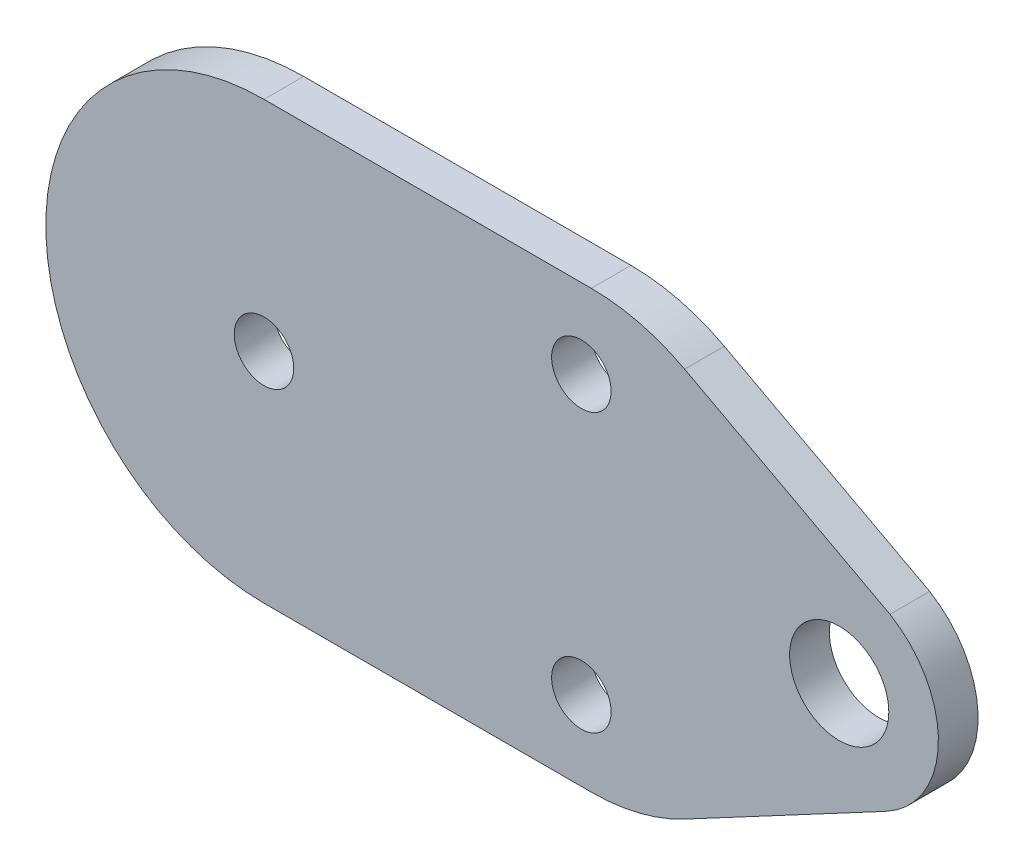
ISO-10303-21;
HEADER;
FILE_DESCRIPTION(('STEP AP214'),'2;1');
FILE_NAME('part.step','',(''),(''),'','','');
FILE_SCHEMA(('AUTOMOTIVE_DESIGN { 1 0 10303 214 1 1 1 1 }'));
ENDSEC;
DATA;
#1=APPLICATION_CONTEXT('core data for automotive mechanical design processes');
#2=APPLICATION_PROTOCOL_DEFINITION('international standard','automotive_design',2000,#1);
#3=PRODUCT_CONTEXT('',#1,'mechanical');
#4=PRODUCT('Part','Part','',(#3));
#5=PRODUCT_RELATED_PRODUCT_CATEGORY('part','',(#4));
#6=PRODUCT_DEFINITION_FORMATION('','',#4);
#7=PRODUCT_DEFINITION_CONTEXT('part definition',#1,'design');
#8=PRODUCT_DEFINITION('design','',#6,#7);
#9=PRODUCT_DEFINITION_SHAPE('','',#8);
#10=(LENGTH_UNIT() NAMED_UNIT(*) SI_UNIT(.MILLI.,.METRE.));
#11=(NAMED_UNIT(*) PLANE_ANGLE_UNIT() SI_UNIT($,.RADIAN.));
#12=(NAMED_UNIT(*) SI_UNIT($,.STERADIAN.) SOLID_ANGLE_UNIT());
#13=UNCERTAINTY_MEASURE_WITH_UNIT(LENGTH_MEASURE(1.E-05),#10,'distance_accuracy_value','');
#14=(GEOMETRIC_REPRESENTATION_CONTEXT(3) GLOBAL_UNCERTAINTY_ASSIGNED_CONTEXT((#13)) GLOBAL_UNIT_ASSIGNED_CONTEXT((#10,
#11,#12)) REPRESENTATION_CONTEXT('',''));
#15=CARTESIAN_POINT('',(0.,0.,0.));
#16=DIRECTION('',(0.,0.,1.));
#17=DIRECTION('',(1.,0.,0.));
#18=AXIS2_PLACEMENT_3D('',#15,#16,#17);
#19=CARTESIAN_POINT('',(0.,0.,2.));
#20=DIRECTION('',(0.,0.,-1.));
#21=DIRECTION('',(-1.,0.,0.));
#22=AXIS2_PLACEMENT_3D('',#19,#20,#21);
#23=PLANE('',#22);
#24=CARTESIAN_POINT('',(16.,-7.,2.));
#25=DIRECTION('',(0.,0.,1.));
#26=DIRECTION('',(-1.,0.,0.));
#27=AXIS2_PLACEMENT_3D('',#24,#25,#26);
#28=CIRCLE('',#27,1.5);
#29=CARTESIAN_POINT('',(14.5,-7.,2.));
#30=VERTEX_POINT('',#29);
#31=EDGE_CURVE('E277',#30,#30,#28,.T.);
#32=ORIENTED_EDGE('',*,*,#31,.F.);
#33=EDGE_LOOP('',(#32));
#34=FACE_BOUND('',#33,.T.);
#35=CARTESIAN_POINT('',(0.,0.,2.));
#36=DIRECTION('',(0.,0.,1.));
#37=DIRECTION('',(1.,0.,0.));
#38=AXIS2_PLACEMENT_3D('',#35,#36,#37);
#39=CIRCLE('',#38,1.5);
#40=CARTESIAN_POINT('',(1.5,0.,2.));
#41=VERTEX_POINT('',#40);
#42=EDGE_CURVE('E118',#41,#41,#39,.T.);
#43=ORIENTED_EDGE('',*,*,#42,.F.);
#44=EDGE_LOOP('',(#43));
#45=FACE_BOUND('',#44,.T.);
#46=DIRECTION('',(1.,0.,0.));
#47=VECTOR('',#46,1.);
#48=CARTESIAN_POINT('',(0.,-11.,2.));
#49=LINE('',#48,#47);
#50=CARTESIAN_POINT('',(0.,-11.,2.));
#51=VERTEX_POINT('',#50);
#52=CARTESIAN_POINT('',(16.5,-11.,2.));
#53=VERTEX_POINT('',#52);
#54=EDGE_CURVE('E108',#51,#53,#49,.T.);
#55=ORIENTED_EDGE('',*,*,#54,.T.);
#56=CARTESIAN_POINT('',(16.5,-0.999999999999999,2.));
#57=DIRECTION('',(0.,0.,-1.));
#58=DIRECTION('',(-1.,0.,0.));
#59=AXIS2_PLACEMENT_3D('',#56,#57,#58);
#60=CIRCLE('',#59,10.);
#61=CARTESIAN_POINT('',(21.2058823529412,-9.82352941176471,2.));
#62=VERTEX_POINT('',#61);
#63=EDGE_CURVE('E157',#53,#62,#60,.F.);
#64=ORIENTED_EDGE('',*,*,#63,.T.);
#65=DIRECTION('',(0.882352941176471,0.470588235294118,0.));
#66=VECTOR('',#65,1.);
#67=CARTESIAN_POINT('',(19.,-11.,2.));
#68=LINE('',#67,#66);
#69=CARTESIAN_POINT('',(31.3529411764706,-4.41176470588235,2.));
#70=VERTEX_POINT('',#69);
#71=EDGE_CURVE('E135',#62,#70,#68,.T.);
#72=ORIENTED_EDGE('',*,*,#71,.T.);
#73=CARTESIAN_POINT('',(29.,0.,2.));
#74=DIRECTION('',(0.,0.,1.));
#75=DIRECTION('',(1.,0.,0.));
#76=AXIS2_PLACEMENT_3D('',#73,#74,#75);
#77=CIRCLE('',#76,5.);
#78=CARTESIAN_POINT('',(31.5585354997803,4.29579982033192,2.));
#79=VERTEX_POINT('',#78);
#80=EDGE_CURVE('E137',#70,#79,#77,.T.);
#81=ORIENTED_EDGE('',*,*,#80,.T.);
#82=DIRECTION('',(-0.882168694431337,0.470933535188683,0.));
#83=VECTOR('',#82,1.);
#84=CARTESIAN_POINT('',(19.,11.,2.));
#85=LINE('',#84,#83);
#86=CARTESIAN_POINT('',(21.2072560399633,9.82168694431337,2.));
#87=VERTEX_POINT('',#86);
#88=EDGE_CURVE('E139',#79,#87,#85,.T.);
#89=ORIENTED_EDGE('',*,*,#88,.T.);
#90=CARTESIAN_POINT('',(16.4979206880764,0.999999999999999,2.));
#91=DIRECTION('',(0.,0.,-1.));
#92=DIRECTION('',(-1.,0.,0.));
#93=AXIS2_PLACEMENT_3D('',#90,#91,#92);
#94=CIRCLE('',#93,10.);
#95=CARTESIAN_POINT('',(16.4979206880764,11.,2.));
#96=VERTEX_POINT('',#95);
#97=EDGE_CURVE('E41',#87,#96,#94,.F.);
#98=ORIENTED_EDGE('',*,*,#97,.T.);
#99=DIRECTION('',(-1.,0.,0.));
#100=VECTOR('',#99,1.);
#101=CARTESIAN_POINT('',(0.,11.,2.));
#102=LINE('',#101,#100);
#103=CARTESIAN_POINT('',(0.,11.,2.));
#104=VERTEX_POINT('',#103);
#105=EDGE_CURVE('E141',#96,#104,#102,.T.);
#106=ORIENTED_EDGE('',*,*,#105,.T.);
#107=CARTESIAN_POINT('',(0.,0.,2.));
#108=DIRECTION('',(0.,0.,1.));
#109=DIRECTION('',(-1.,0.,0.));
#110=AXIS2_PLACEMENT_3D('',#107,#108,#109);
#111=CIRCLE('',#110,11.);
#112=EDGE_CURVE('E132',#104,#51,#111,.T.);
#113=ORIENTED_EDGE('',*,*,#112,.T.);
#114=EDGE_LOOP('',(#55,#64,#72,#81,#89,#98,#106,#113));
#115=FACE_BOUND('',#114,.T.);
#116=CARTESIAN_POINT('',(16.,7.,2.));
#117=DIRECTION('',(0.,0.,1.));
#118=DIRECTION('',(1.,0.,0.));
#119=AXIS2_PLACEMENT_3D('',#116,#117,#118);
#120=CIRCLE('',#119,1.5);
#121=CARTESIAN_POINT('',(17.5,7.,2.));
#122=VERTEX_POINT('',#121);
#123=EDGE_CURVE('E283',#122,#122,#120,.T.);
#124=ORIENTED_EDGE('',*,*,#123,.F.);
#125=EDGE_LOOP('',(#124));
#126=FACE_BOUND('',#125,.T.);
#127=CARTESIAN_POINT('',(29.,0.,2.));
#128=DIRECTION('',(0.,0.,1.));
#129=DIRECTION('',(1.,0.,0.));
#130=AXIS2_PLACEMENT_3D('',#127,#128,#129);
#131=CIRCLE('',#130,2.5);
#132=CARTESIAN_POINT('',(31.5,0.,2.));
#133=VERTEX_POINT('',#132);
#134=EDGE_CURVE('E266',#133,#133,#131,.T.);
#135=ORIENTED_EDGE('',*,*,#134,.F.);
#136=EDGE_LOOP('',(#135));
#137=FACE_BOUND('',#136,.T.);
#138=ADVANCED_FACE('F26',(#34,#45,#115,#126,#137),#23,.F.);
#139=CARTESIAN_POINT('',(0.,0.,0.));
#140=DIRECTION('',(0.,0.,-1.));
#141=DIRECTION('',(-1.,0.,0.));
#142=AXIS2_PLACEMENT_3D('',#139,#140,#141);
#143=PLANE('',#142);
#144=CARTESIAN_POINT('',(16.,-7.,0.));
#145=DIRECTION('',(0.,0.,1.));
#146=DIRECTION('',(-1.,0.,0.));
#147=AXIS2_PLACEMENT_3D('',#144,#145,#146);
#148=CIRCLE('',#147,1.5);
#149=CARTESIAN_POINT('',(14.5,-7.,0.));
#150=VERTEX_POINT('',#149);
#151=EDGE_CURVE('E272',#150,#150,#148,.T.);
#152=ORIENTED_EDGE('',*,*,#151,.T.);
#153=EDGE_LOOP('',(#152));
#154=FACE_BOUND('',#153,.T.);
#155=CARTESIAN_POINT('',(0.,0.,0.));
#156=DIRECTION('',(0.,0.,1.));
#157=DIRECTION('',(1.,0.,0.));
#158=AXIS2_PLACEMENT_3D('',#155,#156,#157);
#159=CIRCLE('',#158,1.5);
#160=CARTESIAN_POINT('',(1.5,0.,0.));
#161=VERTEX_POINT('',#160);
#162=EDGE_CURVE('E121',#161,#161,#159,.T.);
#163=ORIENTED_EDGE('',*,*,#162,.T.);
#164=EDGE_LOOP('',(#163));
#165=FACE_BOUND('',#164,.T.);
#166=DIRECTION('',(0.882352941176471,0.470588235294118,0.));
#167=VECTOR('',#166,1.);
#168=CARTESIAN_POINT('',(19.,-11.,0.));
#169=LINE('',#168,#167);
#170=CARTESIAN_POINT('',(21.2058823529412,-9.82352941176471,0.));
#171=VERTEX_POINT('',#170);
#172=CARTESIAN_POINT('',(31.3529411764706,-4.41176470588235,0.));
#173=VERTEX_POINT('',#172);
#174=EDGE_CURVE('E102',#171,#173,#169,.T.);
#175=ORIENTED_EDGE('',*,*,#174,.F.);
#176=CARTESIAN_POINT('',(16.5,-0.999999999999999,0.));
#177=DIRECTION('',(0.,0.,-1.));
#178=DIRECTION('',(-1.,0.,0.));
#179=AXIS2_PLACEMENT_3D('',#176,#177,#178);
#180=CIRCLE('',#179,10.);
#181=CARTESIAN_POINT('',(16.5,-11.,0.));
#182=VERTEX_POINT('',#181);
#183=EDGE_CURVE('E99',#171,#182,#180,.T.);
#184=ORIENTED_EDGE('',*,*,#183,.T.);
#185=DIRECTION('',(1.,0.,0.));
#186=VECTOR('',#185,1.);
#187=CARTESIAN_POINT('',(0.,-11.,0.));
#188=LINE('',#187,#186);
#189=CARTESIAN_POINT('',(0.,-11.,0.));
#190=VERTEX_POINT('',#189);
#191=EDGE_CURVE('E91',#190,#182,#188,.T.);
#192=ORIENTED_EDGE('',*,*,#191,.F.);
#193=CARTESIAN_POINT('',(0.,0.,0.));
#194=DIRECTION('',(0.,0.,1.));
#195=DIRECTION('',(-1.,0.,0.));
#196=AXIS2_PLACEMENT_3D('',#193,#194,#195);
#197=CIRCLE('',#196,11.);
#198=CARTESIAN_POINT('',(0.,11.,0.));
#199=VERTEX_POINT('',#198);
#200=EDGE_CURVE('E98',#199,#190,#197,.T.);
#201=ORIENTED_EDGE('',*,*,#200,.F.);
#202=DIRECTION('',(-1.,0.,0.));
#203=VECTOR('',#202,1.);
#204=CARTESIAN_POINT('',(0.,11.,0.));
#205=LINE('',#204,#203);
#206=CARTESIAN_POINT('',(16.4979206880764,11.,0.));
#207=VERTEX_POINT('',#206);
#208=EDGE_CURVE('E130',#207,#199,#205,.T.);
#209=ORIENTED_EDGE('',*,*,#208,.F.);
#210=CARTESIAN_POINT('',(16.4979206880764,0.999999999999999,0.));
#211=DIRECTION('',(0.,0.,-1.));
#212=DIRECTION('',(-1.,0.,0.));
#213=AXIS2_PLACEMENT_3D('',#210,#211,#212);
#214=CIRCLE('',#213,10.);
#215=CARTESIAN_POINT('',(21.2072560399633,9.82168694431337,0.));
#216=VERTEX_POINT('',#215);
#217=EDGE_CURVE('E151',#207,#216,#214,.T.);
#218=ORIENTED_EDGE('',*,*,#217,.T.);
#219=DIRECTION('',(-0.882168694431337,0.470933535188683,0.));
#220=VECTOR('',#219,1.);
#221=CARTESIAN_POINT('',(19.,11.,0.));
#222=LINE('',#221,#220);
#223=CARTESIAN_POINT('',(31.5585354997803,4.29579982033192,0.));
#224=VERTEX_POINT('',#223);
#225=EDGE_CURVE('E128',#224,#216,#222,.T.);
#226=ORIENTED_EDGE('',*,*,#225,.F.);
#227=CARTESIAN_POINT('',(29.,0.,0.));
#228=DIRECTION('',(0.,0.,1.));
#229=DIRECTION('',(1.,0.,0.));
#230=AXIS2_PLACEMENT_3D('',#227,#228,#229);
#231=CIRCLE('',#230,5.);
#232=EDGE_CURVE('E126',#173,#224,#231,.T.);
#233=ORIENTED_EDGE('',*,*,#232,.F.);
#234=EDGE_LOOP('',(#175,#184,#192,#201,#209,#218,#226,#233));
#235=FACE_BOUND('',#234,.T.);
#236=CARTESIAN_POINT('',(16.,7.,0.));
#237=DIRECTION('',(0.,0.,1.));
#238=DIRECTION('',(1.,0.,0.));
#239=AXIS2_PLACEMENT_3D('',#236,#237,#238);
#240=CIRCLE('',#239,1.5);
#241=CARTESIAN_POINT('',(17.5,7.,0.));
#242=VERTEX_POINT('',#241);
#243=EDGE_CURVE('E280',#242,#242,#240,.T.);
#244=ORIENTED_EDGE('',*,*,#243,.T.);
#245=EDGE_LOOP('',(#244));
#246=FACE_BOUND('',#245,.T.);
#247=CARTESIAN_POINT('',(29.,0.,0.));
#248=DIRECTION('',(0.,0.,1.));
#249=DIRECTION('',(1.,0.,0.));
#250=AXIS2_PLACEMENT_3D('',#247,#248,#249);
#251=CIRCLE('',#250,2.5);
#252=CARTESIAN_POINT('',(31.5,0.,0.));
#253=VERTEX_POINT('',#252);
#254=EDGE_CURVE('E269',#253,#253,#251,.T.);
#255=ORIENTED_EDGE('',*,*,#254,.T.);
#256=EDGE_LOOP('',(#255));
#257=FACE_BOUND('',#256,.T.);
#258=ADVANCED_FACE('F94',(#154,#165,#235,#246,#257),#143,.T.);
#259=CARTESIAN_POINT('',(0.,0.,2.));
#260=DIRECTION('',(0.,0.,-1.));
#261=DIRECTION('',(-1.,0.,0.));
#262=AXIS2_PLACEMENT_3D('',#259,#260,#261);
#263=CYLINDRICAL_SURFACE('',#262,11.);
#264=ORIENTED_EDGE('',*,*,#200,.T.);
#265=DIRECTION('',(0.,0.,-1.));
#266=VECTOR('',#265,1.);
#267=CARTESIAN_POINT('',(0.,-11.,2.));
#268=LINE('',#267,#266);
#269=EDGE_CURVE('E105',#51,#190,#268,.T.);
#270=ORIENTED_EDGE('',*,*,#269,.F.);
#271=ORIENTED_EDGE('',*,*,#112,.F.);
#272=DIRECTION('',(0.,0.,-1.));
#273=VECTOR('',#272,1.);
#274=CARTESIAN_POINT('',(0.,11.,2.));
#275=LINE('',#274,#273);
#276=EDGE_CURVE('E117',#104,#199,#275,.T.);
#277=ORIENTED_EDGE('',*,*,#276,.T.);
#278=EDGE_LOOP('',(#264,#270,#271,#277));
#279=FACE_BOUND('',#278,.T.);
#280=ADVANCED_FACE('F28',(#279),#263,.T.);
#281=CARTESIAN_POINT('',(0.,-11.,2.));
#282=DIRECTION('',(0.,1.,0.));
#283=DIRECTION('',(0.,0.,1.));
#284=AXIS2_PLACEMENT_3D('',#281,#282,#283);
#285=PLANE('',#284);
#286=ORIENTED_EDGE('',*,*,#191,.T.);
#287=DIRECTION('',(0.,0.,-1.));
#288=VECTOR('',#287,1.);
#289=CARTESIAN_POINT('',(16.5,-11.,2.));
#290=LINE('',#289,#288);
#291=EDGE_CURVE('E154',#182,#53,#290,.F.);
#292=ORIENTED_EDGE('',*,*,#291,.T.);
#293=ORIENTED_EDGE('',*,*,#54,.F.);
#294=ORIENTED_EDGE('',*,*,#269,.T.);
#295=EDGE_LOOP('',(#286,#292,#293,#294));
#296=FACE_BOUND('',#295,.T.);
#297=ADVANCED_FACE('F106',(#296),#285,.F.);
#298=CARTESIAN_POINT('',(19.,-11.,2.));
#299=DIRECTION('',(-0.470588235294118,0.882352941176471,0.));
#300=DIRECTION('',(-0.882352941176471,-0.470588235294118,0.));
#301=AXIS2_PLACEMENT_3D('',#298,#299,#300);
#302=PLANE('',#301);
#303=ORIENTED_EDGE('',*,*,#71,.F.);
#304=DIRECTION('',(0.,0.,-1.));
#305=VECTOR('',#304,1.);
#306=CARTESIAN_POINT('',(21.2058823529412,-9.82352941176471,2.));
#307=LINE('',#306,#305);
#308=EDGE_CURVE('E112',#62,#171,#307,.T.);
#309=ORIENTED_EDGE('',*,*,#308,.T.);
#310=ORIENTED_EDGE('',*,*,#174,.T.);
#311=DIRECTION('',(0.,0.,-1.));
#312=VECTOR('',#311,1.);
#313=CARTESIAN_POINT('',(31.3529411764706,-4.41176470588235,2.));
#314=LINE('',#313,#312);
#315=EDGE_CURVE('E113',#70,#173,#314,.T.);
#316=ORIENTED_EDGE('',*,*,#315,.F.);
#317=EDGE_LOOP('',(#303,#309,#310,#316));
#318=FACE_BOUND('',#317,.T.);
#319=ADVANCED_FACE('F198',(#318),#302,.F.);
#320=CARTESIAN_POINT('',(29.,0.,2.));
#321=DIRECTION('',(0.,0.,-1.));
#322=DIRECTION('',(-1.,0.,0.));
#323=AXIS2_PLACEMENT_3D('',#320,#321,#322);
#324=CYLINDRICAL_SURFACE('',#323,5.);
#325=ORIENTED_EDGE('',*,*,#232,.T.);
#326=DIRECTION('',(0.,0.,-1.));
#327=VECTOR('',#326,1.);
#328=CARTESIAN_POINT('',(31.5585354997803,4.29579982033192,2.));
#329=LINE('',#328,#327);
#330=EDGE_CURVE('E144',#79,#224,#329,.T.);
#331=ORIENTED_EDGE('',*,*,#330,.F.);
#332=ORIENTED_EDGE('',*,*,#80,.F.);
#333=ORIENTED_EDGE('',*,*,#315,.T.);
#334=EDGE_LOOP('',(#325,#331,#332,#333));
#335=FACE_BOUND('',#334,.T.);
#336=ADVANCED_FACE('F195',(#335),#324,.T.);
#337=CARTESIAN_POINT('',(19.,11.,2.));
#338=DIRECTION('',(-0.470933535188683,-0.882168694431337,0.));
#339=DIRECTION('',(0.882168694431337,-0.470933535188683,0.));
#340=AXIS2_PLACEMENT_3D('',#337,#338,#339);
#341=PLANE('',#340);
#342=ORIENTED_EDGE('',*,*,#225,.T.);
#343=DIRECTION('',(0.,0.,-1.));
#344=VECTOR('',#343,1.);
#345=CARTESIAN_POINT('',(21.2072560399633,9.82168694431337,2.));
#346=LINE('',#345,#344);
#347=EDGE_CURVE('E11',#216,#87,#346,.F.);
#348=ORIENTED_EDGE('',*,*,#347,.T.);
#349=ORIENTED_EDGE('',*,*,#88,.F.);
#350=ORIENTED_EDGE('',*,*,#330,.T.);
#351=EDGE_LOOP('',(#342,#348,#349,#350));
#352=FACE_BOUND('',#351,.T.);
#353=ADVANCED_FACE('F165',(#352),#341,.F.);
#354=CARTESIAN_POINT('',(0.,11.,2.));
#355=DIRECTION('',(0.,-1.,0.));
#356=DIRECTION('',(0.,0.,-1.));
#357=AXIS2_PLACEMENT_3D('',#354,#355,#356);
#358=PLANE('',#357);
#359=ORIENTED_EDGE('',*,*,#105,.F.);
#360=DIRECTION('',(0.,0.,-1.));
#361=VECTOR('',#360,1.);
#362=CARTESIAN_POINT('',(16.4979206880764,11.,2.));
#363=LINE('',#362,#361);
#364=EDGE_CURVE('E34',#96,#207,#363,.T.);
#365=ORIENTED_EDGE('',*,*,#364,.T.);
#366=ORIENTED_EDGE('',*,*,#208,.T.);
#367=ORIENTED_EDGE('',*,*,#276,.F.);
#368=EDGE_LOOP('',(#359,#365,#366,#367));
#369=FACE_BOUND('',#368,.T.);
#370=ADVANCED_FACE('F161',(#369),#358,.F.);
#371=CARTESIAN_POINT('',(0.,0.,2.));
#372=DIRECTION('',(0.,0.,-1.));
#373=DIRECTION('',(-1.,0.,0.));
#374=AXIS2_PLACEMENT_3D('',#371,#372,#373);
#375=CYLINDRICAL_SURFACE('',#374,1.5);
#376=ORIENTED_EDGE('',*,*,#42,.T.);
#377=EDGE_LOOP('',(#376));
#378=FACE_BOUND('',#377,.T.);
#379=ORIENTED_EDGE('',*,*,#162,.F.);
#380=EDGE_LOOP('',(#379));
#381=FACE_BOUND('',#380,.T.);
#382=ADVANCED_FACE('F192',(#378,#381),#375,.F.);
#383=CARTESIAN_POINT('',(16.,7.,2.));
#384=DIRECTION('',(0.,0.,-1.));
#385=DIRECTION('',(-1.,0.,0.));
#386=AXIS2_PLACEMENT_3D('',#383,#384,#385);
#387=CYLINDRICAL_SURFACE('',#386,1.5);
#388=ORIENTED_EDGE('',*,*,#123,.T.);
#389=EDGE_LOOP('',(#388));
#390=FACE_BOUND('',#389,.T.);
#391=ORIENTED_EDGE('',*,*,#243,.F.);
#392=EDGE_LOOP('',(#391));
#393=FACE_BOUND('',#392,.T.);
#394=ADVANCED_FACE('F221',(#390,#393),#387,.F.);
#395=CARTESIAN_POINT('',(16.,-7.,2.));
#396=DIRECTION('',(0.,0.,-1.));
#397=DIRECTION('',(-1.,0.,0.));
#398=AXIS2_PLACEMENT_3D('',#395,#396,#397);
#399=CYLINDRICAL_SURFACE('',#398,1.5);
#400=ORIENTED_EDGE('',*,*,#31,.T.);
#401=EDGE_LOOP('',(#400));
#402=FACE_BOUND('',#401,.T.);
#403=ORIENTED_EDGE('',*,*,#151,.F.);
#404=EDGE_LOOP('',(#403));
#405=FACE_BOUND('',#404,.T.);
#406=ADVANCED_FACE('F229',(#402,#405),#399,.F.);
#407=CARTESIAN_POINT('',(29.,0.,2.));
#408=DIRECTION('',(0.,0.,-1.));
#409=DIRECTION('',(-1.,0.,0.));
#410=AXIS2_PLACEMENT_3D('',#407,#408,#409);
#411=CYLINDRICAL_SURFACE('',#410,2.5);
#412=ORIENTED_EDGE('',*,*,#134,.T.);
#413=EDGE_LOOP('',(#412));
#414=FACE_BOUND('',#413,.T.);
#415=ORIENTED_EDGE('',*,*,#254,.F.);
#416=EDGE_LOOP('',(#415));
#417=FACE_BOUND('',#416,.T.);
#418=ADVANCED_FACE('F174',(#414,#417),#411,.F.);
#419=CARTESIAN_POINT('',(16.5,-0.999999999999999,2.));
#420=DIRECTION('',(0.,0.,-1.));
#421=DIRECTION('',(-1.,0.,0.));
#422=AXIS2_PLACEMENT_3D('',#419,#420,#421);
#423=CYLINDRICAL_SURFACE('',#422,10.);
#424=ORIENTED_EDGE('',*,*,#63,.F.);
#425=ORIENTED_EDGE('',*,*,#291,.F.);
#426=ORIENTED_EDGE('',*,*,#183,.F.);
#427=ORIENTED_EDGE('',*,*,#308,.F.);
#428=EDGE_LOOP('',(#424,#425,#426,#427));
#429=FACE_BOUND('',#428,.T.);
#430=ADVANCED_FACE('F169',(#429),#423,.T.);
#431=CARTESIAN_POINT('',(16.4979206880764,0.999999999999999,2.));
#432=DIRECTION('',(0.,0.,-1.));
#433=DIRECTION('',(-1.,0.,0.));
#434=AXIS2_PLACEMENT_3D('',#431,#432,#433);
#435=CYLINDRICAL_SURFACE('',#434,10.);
#436=ORIENTED_EDGE('',*,*,#97,.F.);
#437=ORIENTED_EDGE('',*,*,#347,.F.);
#438=ORIENTED_EDGE('',*,*,#217,.F.);
#439=ORIENTED_EDGE('',*,*,#364,.F.);
#440=EDGE_LOOP('',(#436,#437,#438,#439));
#441=FACE_BOUND('',#440,.T.);
#442=ADVANCED_FACE('F167',(#441),#435,.T.);
#443=CLOSED_SHELL('',(#138,#258,#280,#297,#319,#336,#353,#370,#382,#394,#406,#418,#430,#442));
#444=MANIFOLD_SOLID_BREP('B2',#443);
#445=ADVANCED_BREP_SHAPE_REPRESENTATION('',(#18,#444),#14);
#446=SHAPE_DEFINITION_REPRESENTATION(#9,#445);
ENDSEC;
END-ISO-10303-21;
